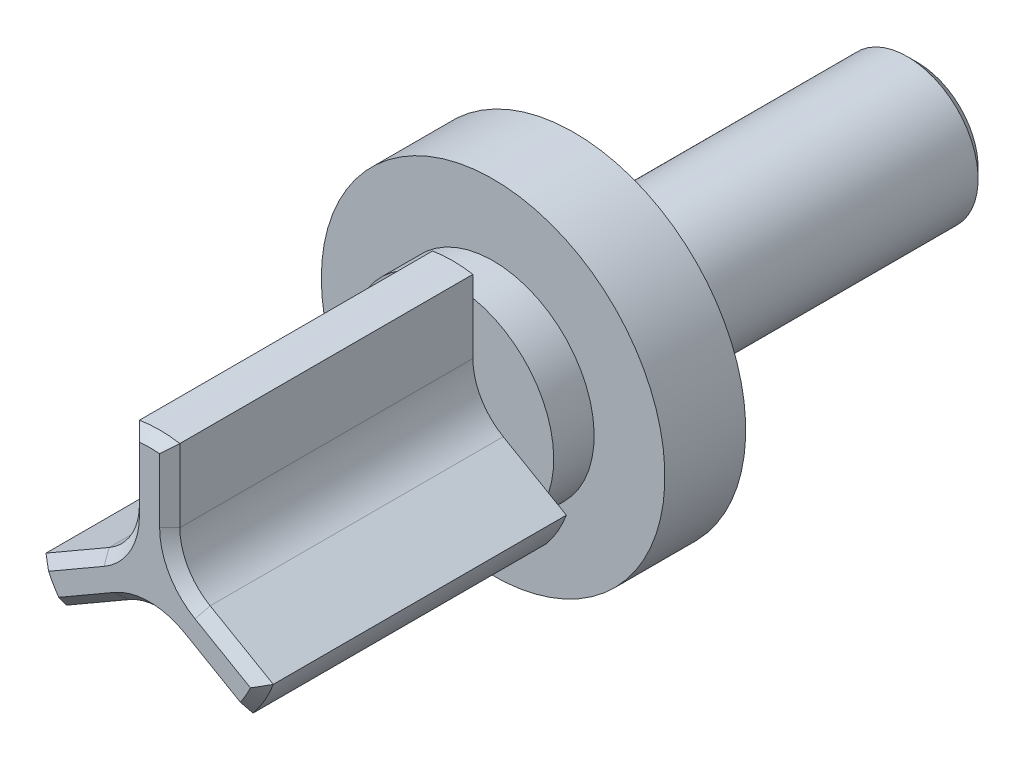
ISO-10303-21;
HEADER;
FILE_DESCRIPTION(('STEP AP214'),'2;1');
FILE_NAME('part.step','',(''),(''),'','','');
FILE_SCHEMA(('AUTOMOTIVE_DESIGN { 1 0 10303 214 1 1 1 1 }'));
ENDSEC;
DATA;
#1=APPLICATION_CONTEXT('core data for automotive mechanical design processes');
#2=APPLICATION_PROTOCOL_DEFINITION('international standard','automotive_design',2000,#1);
#3=PRODUCT_CONTEXT('',#1,'mechanical');
#4=PRODUCT('Part','Part','',(#3));
#5=PRODUCT_RELATED_PRODUCT_CATEGORY('part','',(#4));
#6=PRODUCT_DEFINITION_FORMATION('','',#4);
#7=PRODUCT_DEFINITION_CONTEXT('part definition',#1,'design');
#8=PRODUCT_DEFINITION('design','',#6,#7);
#9=PRODUCT_DEFINITION_SHAPE('','',#8);
#10=(LENGTH_UNIT() NAMED_UNIT(*) SI_UNIT(.MILLI.,.METRE.));
#11=(NAMED_UNIT(*) PLANE_ANGLE_UNIT() SI_UNIT($,.RADIAN.));
#12=(NAMED_UNIT(*) SI_UNIT($,.STERADIAN.) SOLID_ANGLE_UNIT());
#13=UNCERTAINTY_MEASURE_WITH_UNIT(LENGTH_MEASURE(1.E-05),#10,'distance_accuracy_value','');
#14=(GEOMETRIC_REPRESENTATION_CONTEXT(3) GLOBAL_UNCERTAINTY_ASSIGNED_CONTEXT((#13)) GLOBAL_UNIT_ASSIGNED_CONTEXT((#10,
#11,#12)) REPRESENTATION_CONTEXT('',''));
#15=CARTESIAN_POINT('',(0.,0.,0.));
#16=DIRECTION('',(0.,0.,1.));
#17=DIRECTION('',(1.,0.,0.));
#18=AXIS2_PLACEMENT_3D('',#15,#16,#17);
#19=CARTESIAN_POINT('',(0.,0.,-6.));
#20=DIRECTION('',(0.,0.,-1.));
#21=DIRECTION('',(-1.,0.,0.));
#22=AXIS2_PLACEMENT_3D('',#19,#20,#21);
#23=PLANE('',#22);
#24=CARTESIAN_POINT('',(0.,0.,-6.));
#25=DIRECTION('',(0.,0.,-1.));
#26=DIRECTION('',(-1.,0.,0.));
#27=AXIS2_PLACEMENT_3D('',#24,#25,#26);
#28=CIRCLE('',#27,8.5);
#29=CARTESIAN_POINT('',(-8.5,0.,-6.));
#30=VERTEX_POINT('',#29);
#31=EDGE_CURVE('E204',#30,#30,#28,.T.);
#32=ORIENTED_EDGE('',*,*,#31,.T.);
#33=EDGE_LOOP('',(#32));
#34=FACE_BOUND('',#33,.T.);
#35=CARTESIAN_POINT('',(0.,0.,-6.));
#36=DIRECTION('',(0.,0.,-1.));
#37=DIRECTION('',(-1.,0.,0.));
#38=AXIS2_PLACEMENT_3D('',#35,#36,#37);
#39=CIRCLE('',#38,3.5);
#40=CARTESIAN_POINT('',(-3.5,0.,-6.));
#41=VERTEX_POINT('',#40);
#42=EDGE_CURVE('E436',#41,#41,#39,.T.);
#43=ORIENTED_EDGE('',*,*,#42,.F.);
#44=EDGE_LOOP('',(#43));
#45=FACE_BOUND('',#44,.T.);
#46=ADVANCED_FACE('F31',(#34,#45),#23,.T.);
#47=CARTESIAN_POINT('',(4.,2.3094010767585,0.));
#48=DIRECTION('',(0.,0.,1.));
#49=DIRECTION('',(1.,0.,0.));
#50=AXIS2_PLACEMENT_3D('',#47,#48,#49);
#51=PLANE('',#50);
#52=CARTESIAN_POINT('',(0.,0.,0.));
#53=DIRECTION('',(0.,0.,-1.));
#54=DIRECTION('',(-1.,0.,0.));
#55=AXIS2_PLACEMENT_3D('',#52,#53,#54);
#56=CIRCLE('',#55,5.);
#57=CARTESIAN_POINT('',(-0.999999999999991,4.89897948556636,0.));
#58=VERTEX_POINT('',#57);
#59=CARTESIAN_POINT('',(1.,4.89897948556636,0.));
#60=VERTEX_POINT('',#59);
#61=EDGE_CURVE('E206',#58,#60,#56,.T.);
#62=ORIENTED_EDGE('',*,*,#61,.F.);
#63=DIRECTION('',(0.,-1.,0.));
#64=VECTOR('',#63,1.);
#65=CARTESIAN_POINT('',(-0.999999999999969,2.3094010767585,0.));
#66=LINE('',#65,#64);
#67=CARTESIAN_POINT('',(-1.,5.91607978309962,0.));
#68=VERTEX_POINT('',#67);
#69=EDGE_CURVE('E516',#68,#58,#66,.T.);
#70=ORIENTED_EDGE('',*,*,#69,.F.);
#71=CARTESIAN_POINT('',(0.,0.,0.));
#72=DIRECTION('',(0.,0.,1.));
#73=DIRECTION('',(1.,0.,0.));
#74=AXIS2_PLACEMENT_3D('',#71,#72,#73);
#75=CIRCLE('',#74,6.);
#76=CARTESIAN_POINT('',(1.,5.91607978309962,0.));
#77=VERTEX_POINT('',#76);
#78=EDGE_CURVE('E326',#77,#68,#75,.T.);
#79=ORIENTED_EDGE('',*,*,#78,.F.);
#80=DIRECTION('',(0.,1.,0.));
#81=VECTOR('',#80,1.);
#82=CARTESIAN_POINT('',(1.00000000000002,2.30940107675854,0.));
#83=LINE('',#82,#81);
#84=EDGE_CURVE('E514',#60,#77,#83,.T.);
#85=ORIENTED_EDGE('',*,*,#84,.F.);
#86=EDGE_LOOP('',(#62,#70,#79,#85));
#87=FACE_BOUND('',#86,.T.);
#88=ADVANCED_FACE('F462',(#87),#51,.F.);
#89=CARTESIAN_POINT('',(4.74264068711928,-1.58346433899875,0.));
#90=VERTEX_POINT('',#89);
#91=CARTESIAN_POINT('',(3.74264068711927,-3.31551514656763,0.));
#92=VERTEX_POINT('',#91);
#93=EDGE_CURVE('E211',#90,#92,#56,.T.);
#94=ORIENTED_EDGE('',*,*,#93,.F.);
#95=DIRECTION('',(-0.866025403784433,0.500000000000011,0.));
#96=VECTOR('',#95,1.);
#97=CARTESIAN_POINT('',(2.50000000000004,-0.288675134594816,0.));
#98=LINE('',#97,#96);
#99=CARTESIAN_POINT('',(5.62347538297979,-2.0920144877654,0.));
#100=VERTEX_POINT('',#99);
#101=EDGE_CURVE('E237',#100,#90,#98,.T.);
#102=ORIENTED_EDGE('',*,*,#101,.F.);
#103=CARTESIAN_POINT('',(0.,0.,0.));
#104=DIRECTION('',(0.,0.,1.));
#105=DIRECTION('',(1.,0.,0.));
#106=AXIS2_PLACEMENT_3D('',#103,#104,#105);
#107=CIRCLE('',#106,6.);
#108=CARTESIAN_POINT('',(4.62347538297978,-3.82406529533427,0.));
#109=VERTEX_POINT('',#108);
#110=EDGE_CURVE('E238',#109,#100,#107,.T.);
#111=ORIENTED_EDGE('',*,*,#110,.F.);
#112=DIRECTION('',(0.866025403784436,-0.500000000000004,0.));
#113=VECTOR('',#112,1.);
#114=CARTESIAN_POINT('',(1.49999999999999,-2.0207259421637,0.));
#115=LINE('',#114,#113);
#116=EDGE_CURVE('E381',#92,#109,#115,.T.);
#117=ORIENTED_EDGE('',*,*,#116,.F.);
#118=EDGE_LOOP('',(#94,#102,#111,#117));
#119=FACE_BOUND('',#118,.T.);
#120=ADVANCED_FACE('F475',(#119),#51,.F.);
#121=CARTESIAN_POINT('',(-3.74264068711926,-3.31551514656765,0.));
#122=VERTEX_POINT('',#121);
#123=CARTESIAN_POINT('',(-4.74264068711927,-1.58346433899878,0.));
#124=VERTEX_POINT('',#123);
#125=EDGE_CURVE('E191',#122,#124,#56,.T.);
#126=ORIENTED_EDGE('',*,*,#125,.F.);
#127=DIRECTION('',(0.866025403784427,0.500000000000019,0.));
#128=VECTOR('',#127,1.);
#129=CARTESIAN_POINT('',(-1.5,-2.02072594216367,0.));
#130=LINE('',#129,#128);
#131=CARTESIAN_POINT('',(-4.62347538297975,-3.82406529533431,0.));
#132=VERTEX_POINT('',#131);
#133=EDGE_CURVE('E524',#132,#122,#130,.T.);
#134=ORIENTED_EDGE('',*,*,#133,.F.);
#135=CARTESIAN_POINT('',(0.,0.,0.));
#136=DIRECTION('',(0.,0.,1.));
#137=DIRECTION('',(1.,0.,0.));
#138=AXIS2_PLACEMENT_3D('',#135,#136,#137);
#139=CIRCLE('',#138,6.);
#140=CARTESIAN_POINT('',(-5.62347538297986,-2.09201448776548,0.));
#141=VERTEX_POINT('',#140);
#142=EDGE_CURVE('E185',#141,#132,#139,.T.);
#143=ORIENTED_EDGE('',*,*,#142,.F.);
#144=DIRECTION('',(-0.866025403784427,-0.50000000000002,0.));
#145=VECTOR('',#144,1.);
#146=CARTESIAN_POINT('',(-2.5,-0.288675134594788,0.));
#147=LINE('',#146,#145);
#148=EDGE_CURVE('E177',#124,#141,#147,.T.);
#149=ORIENTED_EDGE('',*,*,#148,.F.);
#150=EDGE_LOOP('',(#126,#134,#143,#149));
#151=FACE_BOUND('',#150,.T.);
#152=ADVANCED_FACE('F188',(#151),#51,.F.);
#153=CARTESIAN_POINT('',(4.,2.3094010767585,15.));
#154=DIRECTION('',(0.,0.,-1.));
#155=DIRECTION('',(-1.,0.,0.));
#156=AXIS2_PLACEMENT_3D('',#153,#154,#155);
#157=CYLINDRICAL_SURFACE('',#156,2.99999999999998);
#158=DIRECTION('',(0.,0.,-1.));
#159=VECTOR('',#158,1.);
#160=CARTESIAN_POINT('',(1.00000000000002,2.30940107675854,15.));
#161=LINE('',#160,#159);
#162=CARTESIAN_POINT('',(1.00000000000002,2.30940107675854,14.5));
#163=VERTEX_POINT('',#162);
#164=CARTESIAN_POINT('',(1.00000000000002,2.30940107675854,0.));
#165=VERTEX_POINT('',#164);
#166=EDGE_CURVE('E212',#163,#165,#161,.T.);
#167=ORIENTED_EDGE('',*,*,#166,.F.);
#168=CARTESIAN_POINT('',(4.,2.3094010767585,14.5));
#169=DIRECTION('',(0.,0.,1.));
#170=DIRECTION('',(1.,0.,0.));
#171=AXIS2_PLACEMENT_3D('',#168,#169,#170);
#172=CIRCLE('',#171,2.99999999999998);
#173=CARTESIAN_POINT('',(2.50000000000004,-0.288675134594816,14.5));
#174=VERTEX_POINT('',#173);
#175=EDGE_CURVE('E11',#163,#174,#172,.T.);
#176=ORIENTED_EDGE('',*,*,#175,.T.);
#177=DIRECTION('',(0.,0.,-1.));
#178=VECTOR('',#177,1.);
#179=CARTESIAN_POINT('',(2.50000000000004,-0.288675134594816,15.));
#180=LINE('',#179,#178);
#181=CARTESIAN_POINT('',(2.50000000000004,-0.288675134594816,0.));
#182=VERTEX_POINT('',#181);
#183=EDGE_CURVE('E240',#174,#182,#180,.T.);
#184=ORIENTED_EDGE('',*,*,#183,.T.);
#185=CARTESIAN_POINT('',(4.,2.3094010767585,0.));
#186=DIRECTION('',(0.,0.,-1.));
#187=DIRECTION('',(1.,0.,0.));
#188=AXIS2_PLACEMENT_3D('',#185,#186,#187);
#189=CIRCLE('',#188,2.99999999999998);
#190=EDGE_CURVE('E222',#182,#165,#189,.T.);
#191=ORIENTED_EDGE('',*,*,#190,.T.);
#192=EDGE_LOOP('',(#167,#176,#184,#191));
#193=FACE_BOUND('',#192,.T.);
#194=ADVANCED_FACE('F33',(#193),#157,.F.);
#195=CARTESIAN_POINT('',(1.00000000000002,2.30940107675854,15.));
#196=DIRECTION('',(-1.,0.,0.));
#197=DIRECTION('',(0.,-1.,0.));
#198=AXIS2_PLACEMENT_3D('',#195,#196,#197);
#199=PLANE('',#198);
#200=DIRECTION('',(0.,0.,-1.));
#201=VECTOR('',#200,1.);
#202=CARTESIAN_POINT('',(1.,5.91607978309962,15.));
#203=LINE('',#202,#201);
#204=CARTESIAN_POINT('',(1.,5.91607978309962,14.5));
#205=VERTEX_POINT('',#204);
#206=EDGE_CURVE('E215',#205,#77,#203,.T.);
#207=ORIENTED_EDGE('',*,*,#206,.F.);
#208=DIRECTION('',(0.,-1.,0.));
#209=VECTOR('',#208,1.);
#210=CARTESIAN_POINT('',(1.00000000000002,2.30940107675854,14.5));
#211=LINE('',#210,#209);
#212=EDGE_CURVE('E39',#205,#163,#211,.T.);
#213=ORIENTED_EDGE('',*,*,#212,.T.);
#214=ORIENTED_EDGE('',*,*,#166,.T.);
#215=EDGE_CURVE('E230',#165,#60,#83,.T.);
#216=ORIENTED_EDGE('',*,*,#215,.T.);
#217=ORIENTED_EDGE('',*,*,#84,.T.);
#218=EDGE_LOOP('',(#207,#213,#214,#216,#217));
#219=FACE_BOUND('',#218,.T.);
#220=ADVANCED_FACE('F508',(#219),#199,.F.);
#221=CARTESIAN_POINT('',(0.,0.,15.));
#222=DIRECTION('',(0.,0.,-1.));
#223=DIRECTION('',(-1.,0.,0.));
#224=AXIS2_PLACEMENT_3D('',#221,#222,#223);
#225=CYLINDRICAL_SURFACE('',#224,6.);
#226=DIRECTION('',(0.,0.,-1.));
#227=VECTOR('',#226,1.);
#228=CARTESIAN_POINT('',(-1.,5.91607978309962,15.));
#229=LINE('',#228,#227);
#230=CARTESIAN_POINT('',(-1.,5.91607978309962,14.5));
#231=VERTEX_POINT('',#230);
#232=EDGE_CURVE('E262',#231,#68,#229,.T.);
#233=ORIENTED_EDGE('',*,*,#232,.F.);
#234=CARTESIAN_POINT('',(0.,0.,14.5));
#235=DIRECTION('',(0.,0.,1.));
#236=DIRECTION('',(1.,0.,0.));
#237=AXIS2_PLACEMENT_3D('',#234,#235,#236);
#238=CIRCLE('',#237,6.);
#239=EDGE_CURVE('E53',#231,#205,#238,.F.);
#240=ORIENTED_EDGE('',*,*,#239,.T.);
#241=ORIENTED_EDGE('',*,*,#206,.T.);
#242=ORIENTED_EDGE('',*,*,#78,.T.);
#243=EDGE_LOOP('',(#233,#240,#241,#242));
#244=FACE_BOUND('',#243,.T.);
#245=ADVANCED_FACE('F324',(#244),#225,.T.);
#246=CARTESIAN_POINT('',(-0.999999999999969,2.3094010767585,15.));
#247=DIRECTION('',(1.,0.,0.));
#248=DIRECTION('',(0.,1.,0.));
#249=AXIS2_PLACEMENT_3D('',#246,#247,#248);
#250=PLANE('',#249);
#251=DIRECTION('',(0.,0.,-1.));
#252=VECTOR('',#251,1.);
#253=CARTESIAN_POINT('',(-0.999999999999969,2.3094010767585,15.));
#254=LINE('',#253,#252);
#255=CARTESIAN_POINT('',(-0.999999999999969,2.3094010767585,14.5));
#256=VERTEX_POINT('',#255);
#257=CARTESIAN_POINT('',(-0.999999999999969,2.3094010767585,0.));
#258=VERTEX_POINT('',#257);
#259=EDGE_CURVE('E260',#256,#258,#254,.T.);
#260=ORIENTED_EDGE('',*,*,#259,.F.);
#261=DIRECTION('',(0.,1.,0.));
#262=VECTOR('',#261,1.);
#263=CARTESIAN_POINT('',(-1.,5.91607978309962,14.5));
#264=LINE('',#263,#262);
#265=EDGE_CURVE('E312',#256,#231,#264,.T.);
#266=ORIENTED_EDGE('',*,*,#265,.T.);
#267=ORIENTED_EDGE('',*,*,#232,.T.);
#268=ORIENTED_EDGE('',*,*,#69,.T.);
#269=EDGE_CURVE('E200',#58,#258,#66,.T.);
#270=ORIENTED_EDGE('',*,*,#269,.T.);
#271=EDGE_LOOP('',(#260,#266,#267,#268,#270));
#272=FACE_BOUND('',#271,.T.);
#273=ADVANCED_FACE('F317',(#272),#250,.F.);
#274=CARTESIAN_POINT('',(-3.99999999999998,2.30940107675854,15.));
#275=DIRECTION('',(0.,0.,-1.));
#276=DIRECTION('',(-1.,0.,0.));
#277=AXIS2_PLACEMENT_3D('',#274,#275,#276);
#278=CYLINDRICAL_SURFACE('',#277,3.);
#279=DIRECTION('',(0.,0.,-1.));
#280=VECTOR('',#279,1.);
#281=CARTESIAN_POINT('',(-2.5,-0.288675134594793,15.));
#282=LINE('',#281,#280);
#283=CARTESIAN_POINT('',(-2.5,-0.288675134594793,14.5));
#284=VERTEX_POINT('',#283);
#285=CARTESIAN_POINT('',(-2.5,-0.288675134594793,0.));
#286=VERTEX_POINT('',#285);
#287=EDGE_CURVE('E180',#284,#286,#282,.T.);
#288=ORIENTED_EDGE('',*,*,#287,.F.);
#289=CARTESIAN_POINT('',(-3.99999999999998,2.30940107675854,14.5));
#290=DIRECTION('',(0.,0.,1.));
#291=DIRECTION('',(1.,0.,0.));
#292=AXIS2_PLACEMENT_3D('',#289,#290,#291);
#293=CIRCLE('',#292,3.);
#294=EDGE_CURVE('E310',#284,#256,#293,.T.);
#295=ORIENTED_EDGE('',*,*,#294,.T.);
#296=ORIENTED_EDGE('',*,*,#259,.T.);
#297=CARTESIAN_POINT('',(-3.99999999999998,2.30940107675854,0.));
#298=DIRECTION('',(0.,0.,-1.));
#299=DIRECTION('',(1.,0.,0.));
#300=AXIS2_PLACEMENT_3D('',#297,#298,#299);
#301=CIRCLE('',#300,3.);
#302=EDGE_CURVE('E194',#258,#286,#301,.T.);
#303=ORIENTED_EDGE('',*,*,#302,.T.);
#304=EDGE_LOOP('',(#288,#295,#296,#303));
#305=FACE_BOUND('',#304,.T.);
#306=ADVANCED_FACE('F501',(#305),#278,.F.);
#307=CARTESIAN_POINT('',(-2.5,-0.288675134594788,15.));
#308=DIRECTION('',(0.50000000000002,-0.866025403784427,0.));
#309=DIRECTION('',(0.866025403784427,0.50000000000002,0.));
#310=AXIS2_PLACEMENT_3D('',#307,#308,#309);
#311=PLANE('',#310);
#312=DIRECTION('',(0.,0.,-1.));
#313=VECTOR('',#312,1.);
#314=CARTESIAN_POINT('',(-5.62347538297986,-2.09201448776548,15.));
#315=LINE('',#314,#313);
#316=CARTESIAN_POINT('',(-5.62347538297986,-2.09201448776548,14.5));
#317=VERTEX_POINT('',#316);
#318=EDGE_CURVE('E257',#317,#141,#315,.T.);
#319=ORIENTED_EDGE('',*,*,#318,.F.);
#320=DIRECTION('',(0.866025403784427,0.50000000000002,0.));
#321=VECTOR('',#320,1.);
#322=CARTESIAN_POINT('',(-2.5,-0.288675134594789,14.5));
#323=LINE('',#322,#321);
#324=EDGE_CURVE('E308',#317,#284,#323,.T.);
#325=ORIENTED_EDGE('',*,*,#324,.T.);
#326=ORIENTED_EDGE('',*,*,#287,.T.);
#327=EDGE_CURVE('E173',#286,#124,#147,.T.);
#328=ORIENTED_EDGE('',*,*,#327,.T.);
#329=ORIENTED_EDGE('',*,*,#148,.T.);
#330=EDGE_LOOP('',(#319,#325,#326,#328,#329));
#331=FACE_BOUND('',#330,.T.);
#332=ADVANCED_FACE('F176',(#331),#311,.F.);
#333=CARTESIAN_POINT('',(0.,0.,15.));
#334=DIRECTION('',(0.,0.,-1.));
#335=DIRECTION('',(-1.,0.,0.));
#336=AXIS2_PLACEMENT_3D('',#333,#334,#335);
#337=CYLINDRICAL_SURFACE('',#336,6.);
#338=DIRECTION('',(0.,0.,-1.));
#339=VECTOR('',#338,1.);
#340=CARTESIAN_POINT('',(-4.62347538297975,-3.82406529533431,15.));
#341=LINE('',#340,#339);
#342=CARTESIAN_POINT('',(-4.62347538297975,-3.82406529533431,14.5));
#343=VERTEX_POINT('',#342);
#344=EDGE_CURVE('E255',#343,#132,#341,.T.);
#345=ORIENTED_EDGE('',*,*,#344,.F.);
#346=CARTESIAN_POINT('',(0.,0.,14.5));
#347=DIRECTION('',(0.,0.,1.));
#348=DIRECTION('',(1.,0.,0.));
#349=AXIS2_PLACEMENT_3D('',#346,#347,#348);
#350=CIRCLE('',#349,6.);
#351=EDGE_CURVE('E306',#343,#317,#350,.F.);
#352=ORIENTED_EDGE('',*,*,#351,.T.);
#353=ORIENTED_EDGE('',*,*,#318,.T.);
#354=ORIENTED_EDGE('',*,*,#142,.T.);
#355=EDGE_LOOP('',(#345,#352,#353,#354));
#356=FACE_BOUND('',#355,.T.);
#357=ADVANCED_FACE('F494',(#356),#337,.T.);
#358=CARTESIAN_POINT('',(-1.5,-2.02072594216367,15.));
#359=DIRECTION('',(-0.500000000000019,0.866025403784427,0.));
#360=DIRECTION('',(-0.866025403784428,-0.500000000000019,0.));
#361=AXIS2_PLACEMENT_3D('',#358,#359,#360);
#362=PLANE('',#361);
#363=DIRECTION('',(0.,0.,-1.));
#364=VECTOR('',#363,1.);
#365=CARTESIAN_POINT('',(-1.5,-2.02072594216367,15.));
#366=LINE('',#365,#364);
#367=CARTESIAN_POINT('',(-1.5,-2.02072594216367,14.5));
#368=VERTEX_POINT('',#367);
#369=CARTESIAN_POINT('',(-1.5,-2.02072594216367,0.));
#370=VERTEX_POINT('',#369);
#371=EDGE_CURVE('E253',#368,#370,#366,.T.);
#372=ORIENTED_EDGE('',*,*,#371,.F.);
#373=DIRECTION('',(-0.866025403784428,-0.500000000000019,0.));
#374=VECTOR('',#373,1.);
#375=CARTESIAN_POINT('',(-4.62347538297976,-3.82406529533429,14.5));
#376=LINE('',#375,#374);
#377=EDGE_CURVE('E304',#368,#343,#376,.T.);
#378=ORIENTED_EDGE('',*,*,#377,.T.);
#379=ORIENTED_EDGE('',*,*,#344,.T.);
#380=ORIENTED_EDGE('',*,*,#133,.T.);
#381=EDGE_CURVE('E523',#122,#370,#130,.T.);
#382=ORIENTED_EDGE('',*,*,#381,.T.);
#383=EDGE_LOOP('',(#372,#378,#379,#380,#382));
#384=FACE_BOUND('',#383,.T.);
#385=ADVANCED_FACE('F490',(#384),#362,.F.);
#386=CARTESIAN_POINT('',(0.,-4.61880215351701,15.));
#387=DIRECTION('',(0.,0.,-1.));
#388=DIRECTION('',(-1.,0.,0.));
#389=AXIS2_PLACEMENT_3D('',#386,#387,#388);
#390=CYLINDRICAL_SURFACE('',#389,3.);
#391=DIRECTION('',(0.,0.,-1.));
#392=VECTOR('',#391,1.);
#393=CARTESIAN_POINT('',(1.49999999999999,-2.02072594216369,15.));
#394=LINE('',#393,#392);
#395=CARTESIAN_POINT('',(1.49999999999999,-2.02072594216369,14.5));
#396=VERTEX_POINT('',#395);
#397=CARTESIAN_POINT('',(1.49999999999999,-2.02072594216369,0.));
#398=VERTEX_POINT('',#397);
#399=EDGE_CURVE('E251',#396,#398,#394,.T.);
#400=ORIENTED_EDGE('',*,*,#399,.F.);
#401=CARTESIAN_POINT('',(0.,-4.61880215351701,14.5));
#402=DIRECTION('',(0.,0.,1.));
#403=DIRECTION('',(1.,0.,0.));
#404=AXIS2_PLACEMENT_3D('',#401,#402,#403);
#405=CIRCLE('',#404,3.);
#406=EDGE_CURVE('E302',#396,#368,#405,.T.);
#407=ORIENTED_EDGE('',*,*,#406,.T.);
#408=ORIENTED_EDGE('',*,*,#371,.T.);
#409=CARTESIAN_POINT('',(0.,-4.61880215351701,0.));
#410=DIRECTION('',(0.,0.,-1.));
#411=DIRECTION('',(1.,0.,0.));
#412=AXIS2_PLACEMENT_3D('',#409,#410,#411);
#413=CIRCLE('',#412,3.);
#414=EDGE_CURVE('E526',#370,#398,#413,.T.);
#415=ORIENTED_EDGE('',*,*,#414,.T.);
#416=EDGE_LOOP('',(#400,#407,#408,#415));
#417=FACE_BOUND('',#416,.T.);
#418=ADVANCED_FACE('F487',(#417),#390,.F.);
#419=CARTESIAN_POINT('',(1.49999999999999,-2.0207259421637,15.));
#420=DIRECTION('',(0.500000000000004,0.866025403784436,0.));
#421=DIRECTION('',(-0.866025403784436,0.500000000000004,0.));
#422=AXIS2_PLACEMENT_3D('',#419,#420,#421);
#423=PLANE('',#422);
#424=DIRECTION('',(0.,0.,-1.));
#425=VECTOR('',#424,1.);
#426=CARTESIAN_POINT('',(4.62347538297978,-3.82406529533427,15.));
#427=LINE('',#426,#425);
#428=CARTESIAN_POINT('',(4.62347538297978,-3.82406529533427,14.5));
#429=VERTEX_POINT('',#428);
#430=EDGE_CURVE('E249',#429,#109,#427,.T.);
#431=ORIENTED_EDGE('',*,*,#430,.F.);
#432=DIRECTION('',(-0.866025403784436,0.500000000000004,0.));
#433=VECTOR('',#432,1.);
#434=CARTESIAN_POINT('',(1.49999999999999,-2.0207259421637,14.5));
#435=LINE('',#434,#433);
#436=EDGE_CURVE('E300',#429,#396,#435,.T.);
#437=ORIENTED_EDGE('',*,*,#436,.T.);
#438=ORIENTED_EDGE('',*,*,#399,.T.);
#439=EDGE_CURVE('E242',#398,#92,#115,.T.);
#440=ORIENTED_EDGE('',*,*,#439,.T.);
#441=ORIENTED_EDGE('',*,*,#116,.T.);
#442=EDGE_LOOP('',(#431,#437,#438,#440,#441));
#443=FACE_BOUND('',#442,.T.);
#444=ADVANCED_FACE('F378',(#443),#423,.F.);
#445=CARTESIAN_POINT('',(0.,0.,15.));
#446=DIRECTION('',(0.,0.,-1.));
#447=DIRECTION('',(-1.,0.,0.));
#448=AXIS2_PLACEMENT_3D('',#445,#446,#447);
#449=CYLINDRICAL_SURFACE('',#448,6.);
#450=DIRECTION('',(0.,0.,-1.));
#451=VECTOR('',#450,1.);
#452=CARTESIAN_POINT('',(5.62347538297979,-2.0920144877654,15.));
#453=LINE('',#452,#451);
#454=CARTESIAN_POINT('',(5.62347538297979,-2.0920144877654,14.5));
#455=VERTEX_POINT('',#454);
#456=EDGE_CURVE('E247',#455,#100,#453,.T.);
#457=ORIENTED_EDGE('',*,*,#456,.F.);
#458=CARTESIAN_POINT('',(0.,0.,14.5));
#459=DIRECTION('',(0.,0.,1.));
#460=DIRECTION('',(1.,0.,0.));
#461=AXIS2_PLACEMENT_3D('',#458,#459,#460);
#462=CIRCLE('',#461,6.);
#463=EDGE_CURVE('E298',#455,#429,#462,.F.);
#464=ORIENTED_EDGE('',*,*,#463,.T.);
#465=ORIENTED_EDGE('',*,*,#430,.T.);
#466=ORIENTED_EDGE('',*,*,#110,.T.);
#467=EDGE_LOOP('',(#457,#464,#465,#466));
#468=FACE_BOUND('',#467,.T.);
#469=ADVANCED_FACE('F374',(#468),#449,.T.);
#470=CARTESIAN_POINT('',(2.50000000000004,-0.288675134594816,15.));
#471=DIRECTION('',(-0.500000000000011,-0.866025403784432,0.));
#472=DIRECTION('',(0.866025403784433,-0.500000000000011,0.));
#473=AXIS2_PLACEMENT_3D('',#470,#471,#472);
#474=PLANE('',#473);
#475=ORIENTED_EDGE('',*,*,#183,.F.);
#476=DIRECTION('',(0.866025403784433,-0.500000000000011,0.));
#477=VECTOR('',#476,1.);
#478=CARTESIAN_POINT('',(5.62347538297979,-2.0920144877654,14.5));
#479=LINE('',#478,#477);
#480=EDGE_CURVE('E295',#174,#455,#479,.T.);
#481=ORIENTED_EDGE('',*,*,#480,.T.);
#482=ORIENTED_EDGE('',*,*,#456,.T.);
#483=ORIENTED_EDGE('',*,*,#101,.T.);
#484=EDGE_CURVE('E232',#90,#182,#98,.T.);
#485=ORIENTED_EDGE('',*,*,#484,.T.);
#486=EDGE_LOOP('',(#475,#481,#482,#483,#485));
#487=FACE_BOUND('',#486,.T.);
#488=ADVANCED_FACE('F359',(#487),#474,.F.);
#489=CARTESIAN_POINT('',(4.,2.3094010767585,15.));
#490=DIRECTION('',(0.,0.,1.));
#491=DIRECTION('',(1.,0.,0.));
#492=AXIS2_PLACEMENT_3D('',#489,#490,#491);
#493=PLANE('',#492);
#494=CARTESIAN_POINT('',(0.,0.,15.));
#495=DIRECTION('',(0.,0.,1.));
#496=DIRECTION('',(1.,0.,0.));
#497=AXIS2_PLACEMENT_3D('',#494,#495,#496);
#498=CIRCLE('',#497,5.5);
#499=CARTESIAN_POINT('',(4.49341649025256,-3.17162548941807,15.));
#500=VERTEX_POINT('',#499);
#501=CARTESIAN_POINT('',(4.99341649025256,-2.30560008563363,15.));
#502=VERTEX_POINT('',#501);
#503=EDGE_CURVE('E290',#500,#502,#498,.T.);
#504=ORIENTED_EDGE('',*,*,#503,.T.);
#505=DIRECTION('',(-0.866025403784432,0.500000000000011,0.));
#506=VECTOR('',#505,1.);
#507=CARTESIAN_POINT('',(2.25000000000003,-0.721687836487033,15.));
#508=LINE('',#507,#506);
#509=CARTESIAN_POINT('',(2.25000000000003,-0.721687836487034,15.));
#510=VERTEX_POINT('',#509);
#511=EDGE_CURVE('E292',#502,#510,#508,.T.);
#512=ORIENTED_EDGE('',*,*,#511,.T.);
#513=CARTESIAN_POINT('',(4.,2.3094010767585,15.));
#514=DIRECTION('',(0.,0.,1.));
#515=DIRECTION('',(1.,0.,0.));
#516=AXIS2_PLACEMENT_3D('',#513,#514,#515);
#517=CIRCLE('',#516,3.49999999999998);
#518=CARTESIAN_POINT('',(0.500000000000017,2.30940107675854,15.));
#519=VERTEX_POINT('',#518);
#520=EDGE_CURVE('E270',#510,#519,#517,.F.);
#521=ORIENTED_EDGE('',*,*,#520,.T.);
#522=DIRECTION('',(0.,1.,0.));
#523=VECTOR('',#522,1.);
#524=CARTESIAN_POINT('',(0.5,5.91607978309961,15.));
#525=LINE('',#524,#523);
#526=CARTESIAN_POINT('',(0.500000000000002,5.47722557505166,15.));
#527=VERTEX_POINT('',#526);
#528=EDGE_CURVE('E272',#519,#527,#525,.T.);
#529=ORIENTED_EDGE('',*,*,#528,.T.);
#530=CARTESIAN_POINT('',(0.,0.,15.));
#531=DIRECTION('',(0.,0.,1.));
#532=DIRECTION('',(1.,0.,0.));
#533=AXIS2_PLACEMENT_3D('',#530,#531,#532);
#534=CIRCLE('',#533,5.5);
#535=CARTESIAN_POINT('',(-0.499999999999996,5.47722557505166,15.));
#536=VERTEX_POINT('',#535);
#537=EDGE_CURVE('E274',#527,#536,#534,.T.);
#538=ORIENTED_EDGE('',*,*,#537,.T.);
#539=DIRECTION('',(0.,-1.,0.));
#540=VECTOR('',#539,1.);
#541=CARTESIAN_POINT('',(-0.499999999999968,2.3094010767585,15.));
#542=LINE('',#541,#540);
#543=CARTESIAN_POINT('',(-0.499999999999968,2.30940107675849,15.));
#544=VERTEX_POINT('',#543);
#545=EDGE_CURVE('E276',#536,#544,#542,.T.);
#546=ORIENTED_EDGE('',*,*,#545,.T.);
#547=CARTESIAN_POINT('',(-3.99999999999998,2.30940107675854,15.));
#548=DIRECTION('',(0.,0.,1.));
#549=DIRECTION('',(1.,0.,0.));
#550=AXIS2_PLACEMENT_3D('',#547,#548,#549);
#551=CIRCLE('',#550,3.5);
#552=CARTESIAN_POINT('',(-2.24999999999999,-0.721687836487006,15.));
#553=VERTEX_POINT('',#552);
#554=EDGE_CURVE('E278',#544,#553,#551,.F.);
#555=ORIENTED_EDGE('',*,*,#554,.T.);
#556=DIRECTION('',(-0.866025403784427,-0.50000000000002,0.));
#557=VECTOR('',#556,1.);
#558=CARTESIAN_POINT('',(-5.37347538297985,-2.52502718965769,15.));
#559=LINE('',#558,#557);
#560=CARTESIAN_POINT('',(-4.99341649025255,-2.30560008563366,15.));
#561=VERTEX_POINT('',#560);
#562=EDGE_CURVE('E280',#553,#561,#559,.T.);
#563=ORIENTED_EDGE('',*,*,#562,.T.);
#564=CARTESIAN_POINT('',(0.,0.,15.));
#565=DIRECTION('',(0.,0.,1.));
#566=DIRECTION('',(1.,0.,0.));
#567=AXIS2_PLACEMENT_3D('',#564,#565,#566);
#568=CIRCLE('',#567,5.5);
#569=CARTESIAN_POINT('',(-4.49341649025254,-3.17162548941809,15.));
#570=VERTEX_POINT('',#569);
#571=EDGE_CURVE('E282',#561,#570,#568,.T.);
#572=ORIENTED_EDGE('',*,*,#571,.T.);
#573=DIRECTION('',(0.866025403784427,0.500000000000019,0.));
#574=VECTOR('',#573,1.);
#575=CARTESIAN_POINT('',(-1.75000000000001,-1.58771324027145,15.));
#576=LINE('',#575,#574);
#577=CARTESIAN_POINT('',(-1.75,-1.58771324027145,15.));
#578=VERTEX_POINT('',#577);
#579=EDGE_CURVE('E284',#570,#578,#576,.T.);
#580=ORIENTED_EDGE('',*,*,#579,.T.);
#581=CARTESIAN_POINT('',(0.,-4.61880215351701,15.));
#582=DIRECTION('',(0.,0.,1.));
#583=DIRECTION('',(1.,0.,0.));
#584=AXIS2_PLACEMENT_3D('',#581,#582,#583);
#585=CIRCLE('',#584,3.5);
#586=CARTESIAN_POINT('',(1.74999999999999,-1.58771324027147,15.));
#587=VERTEX_POINT('',#586);
#588=EDGE_CURVE('E286',#578,#587,#585,.F.);
#589=ORIENTED_EDGE('',*,*,#588,.T.);
#590=DIRECTION('',(0.866025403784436,-0.500000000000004,0.));
#591=VECTOR('',#590,1.);
#592=CARTESIAN_POINT('',(4.87347538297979,-3.39105259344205,15.));
#593=LINE('',#592,#591);
#594=EDGE_CURVE('E288',#587,#500,#593,.T.);
#595=ORIENTED_EDGE('',*,*,#594,.T.);
#596=EDGE_LOOP('',(#504,#512,#521,#529,#538,#546,#555,#563,#572,#580,#589,#595));
#597=FACE_BOUND('',#596,.T.);
#598=ADVANCED_FACE('F477',(#597),#493,.T.);
#599=CARTESIAN_POINT('',(0.,0.,0.));
#600=DIRECTION('',(0.,0.,-1.));
#601=DIRECTION('',(-1.,0.,0.));
#602=AXIS2_PLACEMENT_3D('',#599,#600,#601);
#603=PLANE('',#602);
#604=ORIENTED_EDGE('',*,*,#439,.F.);
#605=ORIENTED_EDGE('',*,*,#414,.F.);
#606=ORIENTED_EDGE('',*,*,#381,.F.);
#607=EDGE_CURVE('E203',#92,#122,#56,.T.);
#608=ORIENTED_EDGE('',*,*,#607,.F.);
#609=EDGE_LOOP('',(#604,#605,#606,#608));
#610=FACE_BOUND('',#609,.T.);
#611=ADVANCED_FACE('F469',(#610),#603,.F.);
#612=ORIENTED_EDGE('',*,*,#327,.F.);
#613=ORIENTED_EDGE('',*,*,#302,.F.);
#614=ORIENTED_EDGE('',*,*,#269,.F.);
#615=EDGE_CURVE('E197',#124,#58,#56,.T.);
#616=ORIENTED_EDGE('',*,*,#615,.F.);
#617=EDGE_LOOP('',(#612,#613,#614,#616));
#618=FACE_BOUND('',#617,.T.);
#619=ADVANCED_FACE('F198',(#618),#603,.F.);
#620=CARTESIAN_POINT('',(0.,0.,-2.));
#621=DIRECTION('',(0.,0.,1.));
#622=DIRECTION('',(1.,0.,0.));
#623=AXIS2_PLACEMENT_3D('',#620,#621,#622);
#624=CYLINDRICAL_SURFACE('',#623,5.);
#625=CARTESIAN_POINT('',(0.,0.,-2.));
#626=DIRECTION('',(0.,0.,-1.));
#627=DIRECTION('',(-1.,0.,0.));
#628=AXIS2_PLACEMENT_3D('',#625,#626,#627);
#629=CIRCLE('',#628,5.);
#630=CARTESIAN_POINT('',(-5.,0.,-2.));
#631=VERTEX_POINT('',#630);
#632=EDGE_CURVE('E219',#631,#631,#629,.T.);
#633=ORIENTED_EDGE('',*,*,#632,.F.);
#634=EDGE_LOOP('',(#633));
#635=FACE_BOUND('',#634,.T.);
#636=ORIENTED_EDGE('',*,*,#61,.T.);
#637=EDGE_CURVE('E214',#60,#90,#56,.T.);
#638=ORIENTED_EDGE('',*,*,#637,.T.);
#639=ORIENTED_EDGE('',*,*,#93,.T.);
#640=ORIENTED_EDGE('',*,*,#607,.T.);
#641=ORIENTED_EDGE('',*,*,#125,.T.);
#642=ORIENTED_EDGE('',*,*,#615,.T.);
#643=EDGE_LOOP('',(#636,#638,#639,#640,#641,#642));
#644=FACE_BOUND('',#643,.T.);
#645=ADVANCED_FACE('F208',(#635,#644),#624,.T.);
#646=ORIENTED_EDGE('',*,*,#484,.F.);
#647=ORIENTED_EDGE('',*,*,#637,.F.);
#648=ORIENTED_EDGE('',*,*,#215,.F.);
#649=ORIENTED_EDGE('',*,*,#190,.F.);
#650=EDGE_LOOP('',(#646,#647,#648,#649));
#651=FACE_BOUND('',#650,.T.);
#652=ADVANCED_FACE('F227',(#651),#603,.F.);
#653=CARTESIAN_POINT('',(0.,0.,-2.));
#654=DIRECTION('',(0.,0.,-1.));
#655=DIRECTION('',(-1.,0.,0.));
#656=AXIS2_PLACEMENT_3D('',#653,#654,#655);
#657=PLANE('',#656);
#658=CARTESIAN_POINT('',(0.,0.,-2.));
#659=DIRECTION('',(0.,0.,-1.));
#660=DIRECTION('',(-1.,0.,0.));
#661=AXIS2_PLACEMENT_3D('',#658,#659,#660);
#662=CIRCLE('',#661,8.5);
#663=CARTESIAN_POINT('',(-8.5,0.,-2.));
#664=VERTEX_POINT('',#663);
#665=EDGE_CURVE('E816',#664,#664,#662,.T.);
#666=ORIENTED_EDGE('',*,*,#665,.F.);
#667=EDGE_LOOP('',(#666));
#668=FACE_BOUND('',#667,.T.);
#669=ORIENTED_EDGE('',*,*,#632,.T.);
#670=EDGE_LOOP('',(#669));
#671=FACE_BOUND('',#670,.T.);
#672=ADVANCED_FACE('F456',(#668,#671),#657,.F.);
#673=CARTESIAN_POINT('',(0.,0.,-6.));
#674=DIRECTION('',(0.,0.,1.));
#675=DIRECTION('',(1.,0.,0.));
#676=AXIS2_PLACEMENT_3D('',#673,#674,#675);
#677=CYLINDRICAL_SURFACE('',#676,8.5);
#678=ORIENTED_EDGE('',*,*,#31,.F.);
#679=EDGE_LOOP('',(#678));
#680=FACE_BOUND('',#679,.T.);
#681=ORIENTED_EDGE('',*,*,#665,.T.);
#682=EDGE_LOOP('',(#681));
#683=FACE_BOUND('',#682,.T.);
#684=ADVANCED_FACE('F454',(#680,#683),#677,.T.);
#685=CARTESIAN_POINT('',(0.,0.,-23.));
#686=DIRECTION('',(0.,0.,1.));
#687=DIRECTION('',(1.,0.,0.));
#688=AXIS2_PLACEMENT_3D('',#685,#686,#687);
#689=CYLINDRICAL_SURFACE('',#688,3.5);
#690=CARTESIAN_POINT('',(0.,0.,-22.5));
#691=DIRECTION('',(0.,0.,-1.));
#692=DIRECTION('',(-1.,0.,0.));
#693=AXIS2_PLACEMENT_3D('',#690,#691,#692);
#694=CIRCLE('',#693,3.5);
#695=CARTESIAN_POINT('',(-3.5,0.,-22.5));
#696=VERTEX_POINT('',#695);
#697=EDGE_CURVE('E267',#696,#696,#694,.F.);
#698=ORIENTED_EDGE('',*,*,#697,.T.);
#699=EDGE_LOOP('',(#698));
#700=FACE_BOUND('',#699,.T.);
#701=ORIENTED_EDGE('',*,*,#42,.T.);
#702=EDGE_LOOP('',(#701));
#703=FACE_BOUND('',#702,.T.);
#704=ADVANCED_FACE('F450',(#700,#703),#689,.T.);
#705=CARTESIAN_POINT('',(0.,0.,-23.));
#706=DIRECTION('',(0.,0.,-1.));
#707=DIRECTION('',(-1.,0.,0.));
#708=AXIS2_PLACEMENT_3D('',#705,#706,#707);
#709=PLANE('',#708);
#710=CARTESIAN_POINT('',(0.,0.,-23.));
#711=DIRECTION('',(0.,0.,-1.));
#712=DIRECTION('',(-1.,0.,0.));
#713=AXIS2_PLACEMENT_3D('',#710,#711,#712);
#714=CIRCLE('',#713,3.);
#715=CARTESIAN_POINT('',(-3.,0.,-23.));
#716=VERTEX_POINT('',#715);
#717=EDGE_CURVE('E213',#716,#716,#714,.T.);
#718=ORIENTED_EDGE('',*,*,#717,.T.);
#719=EDGE_LOOP('',(#718));
#720=FACE_BOUND('',#719,.T.);
#721=ADVANCED_FACE('F446',(#720),#709,.T.);
#722=CARTESIAN_POINT('',(0.,0.,-23.));
#723=DIRECTION('',(0.,0.,1.));
#724=DIRECTION('',(1.,0.,0.));
#725=AXIS2_PLACEMENT_3D('',#722,#723,#724);
#726=CONICAL_SURFACE('',#725,3.,0.785398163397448);
#727=ORIENTED_EDGE('',*,*,#697,.F.);
#728=EDGE_LOOP('',(#727));
#729=FACE_BOUND('',#728,.T.);
#730=ORIENTED_EDGE('',*,*,#717,.F.);
#731=EDGE_LOOP('',(#730));
#732=FACE_BOUND('',#731,.T.);
#733=ADVANCED_FACE('F442',(#729,#732),#726,.T.);
#734=CARTESIAN_POINT('',(3.7499999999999,2.74241377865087,15.));
#735=DIRECTION('',(-0.353553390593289,0.612372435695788,0.707106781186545));
#736=DIRECTION('',(0.,-0.755928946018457,0.654653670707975));
#737=AXIS2_PLACEMENT_3D('',#734,#735,#736);
#738=PLANE('',#737);
#739=DIRECTION('',(0.353553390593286,-0.612372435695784,0.707106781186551));
#740=VECTOR('',#739,1.);
#741=CARTESIAN_POINT('',(-2.5,-0.288675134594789,14.5));
#742=LINE('',#741,#740);
#743=EDGE_CURVE('E437',#284,#553,#742,.T.);
#744=ORIENTED_EDGE('',*,*,#743,.F.);
#745=ORIENTED_EDGE('',*,*,#324,.F.);
#746=CARTESIAN_POINT('',(-5.62347538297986,-2.09201448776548,14.5));
#747=CARTESIAN_POINT('',(-5.5716132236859,-2.11068276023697,14.5420982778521));
#748=CARTESIAN_POINT('',(-5.5195963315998,-2.12914663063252,14.5840969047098));
#749=CARTESIAN_POINT('',(-5.41524744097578,-2.16564521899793,14.6678800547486));
#750=CARTESIAN_POINT('',(-5.36291546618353,-2.18367996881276,14.7096645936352));
#751=CARTESIAN_POINT('',(-5.25792262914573,-2.21930289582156,14.7930113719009));
#752=CARTESIAN_POINT('',(-5.20526176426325,-2.23689106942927,14.8345736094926));
#753=CARTESIAN_POINT('',(-5.09959755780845,-2.27160100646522,14.9174653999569));
#754=CARTESIAN_POINT('',(-5.04659419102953,-2.28872273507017,14.958794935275));
#755=CARTESIAN_POINT('',(-4.99341649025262,-2.30560008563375,15.));
#756=B_SPLINE_CURVE_WITH_KNOTS('',3,(#746,#747,#748,#749,#750,#751,#752,#753,#754,#755),
.UNSPECIFIED.,.F.,.F.,(4,2,2,2,4),(0.,0.208072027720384,0.416128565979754,0.624186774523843,
0.832260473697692),.UNSPECIFIED.);
#757=EDGE_CURVE('E429',#561,#317,#756,.F.);
#758=ORIENTED_EDGE('',*,*,#757,.F.);
#759=ORIENTED_EDGE('',*,*,#562,.F.);
#760=EDGE_LOOP('',(#744,#745,#758,#759));
#761=FACE_BOUND('',#760,.T.);
#762=ADVANCED_FACE('F417',(#761),#738,.T.);
#763=CARTESIAN_POINT('',(0.,0.,15.));
#764=DIRECTION('',(0.,0.,-1.));
#765=DIRECTION('',(-1.,0.,0.));
#766=AXIS2_PLACEMENT_3D('',#763,#764,#765);
#767=CONICAL_SURFACE('',#766,5.5,0.785398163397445);
#768=ORIENTED_EDGE('',*,*,#757,.T.);
#769=ORIENTED_EDGE('',*,*,#351,.F.);
#770=CARTESIAN_POINT('',(-4.62347538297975,-3.82406529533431,14.5));
#771=CARTESIAN_POINT('',(-4.61371150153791,-3.76981721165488,14.5420982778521));
#772=CARTESIAN_POINT('',(-4.60369323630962,-3.71553732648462,14.5840969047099));
#773=CARTESIAN_POINT('',(-4.58312749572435,-3.6069192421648,14.6678800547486));
#774=CARTESIAN_POINT('',(-4.57258005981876,-3.55258104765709,14.7096645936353));
#775=CARTESIAN_POINT('',(-4.55093400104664,-3.44384312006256,14.7930113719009));
#776=CARTESIAN_POINT('',(-4.53983537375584,-3.38944338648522,14.8345736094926));
#777=CARTESIAN_POINT('',(-4.51706295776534,-3.28058053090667,14.9174653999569));
#778=CARTESIAN_POINT('',(-4.50538912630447,-3.22611740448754,14.958794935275));
#779=CARTESIAN_POINT('',(-4.49341649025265,-3.17162548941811,15.));
#780=B_SPLINE_CURVE_WITH_KNOTS('',3,(#770,#771,#772,#773,#774,#775,#776,#777,#778,#779),
.UNSPECIFIED.,.F.,.F.,(4,2,2,2,4),(0.,0.208072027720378,0.416128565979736,0.624186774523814,
0.832260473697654),.UNSPECIFIED.);
#781=EDGE_CURVE('E423',#570,#343,#780,.F.);
#782=ORIENTED_EDGE('',*,*,#781,.F.);
#783=ORIENTED_EDGE('',*,*,#571,.F.);
#784=EDGE_LOOP('',(#768,#769,#782,#783));
#785=FACE_BOUND('',#784,.T.);
#786=ADVANCED_FACE('F412',(#785),#767,.T.);
#787=CARTESIAN_POINT('',(-3.99999999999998,2.30940107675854,15.));
#788=DIRECTION('',(0.,0.,1.));
#789=DIRECTION('',(1.,0.,0.));
#790=AXIS2_PLACEMENT_3D('',#787,#788,#789);
#791=CONICAL_SURFACE('',#790,3.5,0.785398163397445);
#792=ORIENTED_EDGE('',*,*,#743,.T.);
#793=ORIENTED_EDGE('',*,*,#554,.F.);
#794=DIRECTION('',(0.707106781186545,0.,0.70710678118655));
#795=VECTOR('',#794,1.);
#796=CARTESIAN_POINT('',(-0.999999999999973,2.3094010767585,14.5));
#797=LINE('',#796,#795);
#798=EDGE_CURVE('E550',#256,#544,#797,.T.);
#799=ORIENTED_EDGE('',*,*,#798,.F.);
#800=ORIENTED_EDGE('',*,*,#294,.F.);
#801=EDGE_LOOP('',(#792,#793,#799,#800));
#802=FACE_BOUND('',#801,.T.);
#803=ADVANCED_FACE('F416',(#802),#791,.F.);
#804=CARTESIAN_POINT('',(4.24999999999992,1.87638837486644,15.));
#805=DIRECTION('',(0.353553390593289,-0.612372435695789,0.707106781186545));
#806=DIRECTION('',(0.,-0.755928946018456,-0.654653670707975));
#807=AXIS2_PLACEMENT_3D('',#804,#805,#806);
#808=PLANE('',#807);
#809=ORIENTED_EDGE('',*,*,#781,.T.);
#810=ORIENTED_EDGE('',*,*,#377,.F.);
#811=DIRECTION('',(0.353553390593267,-0.612372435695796,-0.70710678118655));
#812=VECTOR('',#811,1.);
#813=CARTESIAN_POINT('',(-1.75,-1.58771324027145,15.));
#814=LINE('',#813,#812);
#815=EDGE_CURVE('E334',#578,#368,#814,.T.);
#816=ORIENTED_EDGE('',*,*,#815,.F.);
#817=ORIENTED_EDGE('',*,*,#579,.F.);
#818=EDGE_LOOP('',(#809,#810,#816,#817));
#819=FACE_BOUND('',#818,.T.);
#820=ADVANCED_FACE('F409',(#819),#808,.T.);
#821=CARTESIAN_POINT('',(-0.499999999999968,2.30940107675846,15.));
#822=DIRECTION('',(-0.70710678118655,0.,0.707106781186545));
#823=DIRECTION('',(0.707106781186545,0.,0.70710678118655));
#824=AXIS2_PLACEMENT_3D('',#821,#822,#823);
#825=PLANE('',#824);
#826=ORIENTED_EDGE('',*,*,#798,.T.);
#827=ORIENTED_EDGE('',*,*,#545,.F.);
#828=CARTESIAN_POINT('',(-1.,5.91607978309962,14.5));
#829=CARTESIAN_POINT('',(-0.957901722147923,5.88049997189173,14.5420982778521));
#830=CARTESIAN_POINT('',(-0.915903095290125,5.84468395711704,14.5840969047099));
#831=CARTESIAN_POINT('',(-0.832119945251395,5.77256446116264,14.6678800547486));
#832=CARTESIAN_POINT('',(-0.790335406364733,5.73626101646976,14.7096645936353));
#833=CARTESIAN_POINT('',(-0.706988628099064,5.66314601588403,14.7930113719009));
#834=CARTESIAN_POINT('',(-0.665426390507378,5.62633445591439,14.8345736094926));
#835=CARTESIAN_POINT('',(-0.582534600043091,5.5521815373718,14.9174653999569));
#836=CARTESIAN_POINT('',(-0.541205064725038,5.51484013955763,14.958794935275));
#837=CARTESIAN_POINT('',(-0.499999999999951,5.47722557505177,15.));
#838=B_SPLINE_CURVE_WITH_KNOTS('',3,(#828,#829,#830,#831,#832,#833,#834,#835,#836,#837),
.UNSPECIFIED.,.F.,.F.,(4,2,2,2,4),(0.,0.208072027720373,0.416128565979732,0.624186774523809,
0.832260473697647),.UNSPECIFIED.);
#839=EDGE_CURVE('E330',#231,#536,#838,.T.);
#840=ORIENTED_EDGE('',*,*,#839,.F.);
#841=ORIENTED_EDGE('',*,*,#265,.F.);
#842=EDGE_LOOP('',(#826,#827,#840,#841));
#843=FACE_BOUND('',#842,.T.);
#844=ADVANCED_FACE('F331',(#843),#825,.T.);
#845=CARTESIAN_POINT('',(0.,-4.61880215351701,15.));
#846=DIRECTION('',(0.,0.,1.));
#847=DIRECTION('',(1.,0.,0.));
#848=AXIS2_PLACEMENT_3D('',#845,#846,#847);
#849=CONICAL_SURFACE('',#848,3.5,0.785398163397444);
#850=ORIENTED_EDGE('',*,*,#815,.T.);
#851=ORIENTED_EDGE('',*,*,#406,.F.);
#852=DIRECTION('',(-0.353553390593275,-0.612372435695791,-0.70710678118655));
#853=VECTOR('',#852,1.);
#854=CARTESIAN_POINT('',(1.74999999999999,-1.58771324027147,15.));
#855=LINE('',#854,#853);
#856=EDGE_CURVE('E335',#587,#396,#855,.T.);
#857=ORIENTED_EDGE('',*,*,#856,.F.);
#858=ORIENTED_EDGE('',*,*,#588,.F.);
#859=EDGE_LOOP('',(#850,#851,#857,#858));
#860=FACE_BOUND('',#859,.T.);
#861=ADVANCED_FACE('F408',(#860),#849,.F.);
#862=CARTESIAN_POINT('',(0.,0.,15.));
#863=DIRECTION('',(0.,0.,-1.));
#864=DIRECTION('',(-1.,0.,0.));
#865=AXIS2_PLACEMENT_3D('',#862,#863,#864);
#866=CONICAL_SURFACE('',#865,5.5,0.785398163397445);
#867=ORIENTED_EDGE('',*,*,#839,.T.);
#868=ORIENTED_EDGE('',*,*,#537,.F.);
#869=CARTESIAN_POINT('',(1.,5.91607978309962,14.5));
#870=CARTESIAN_POINT('',(0.957901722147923,5.88049997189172,14.5420982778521));
#871=CARTESIAN_POINT('',(0.915903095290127,5.84468395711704,14.5840969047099));
#872=CARTESIAN_POINT('',(0.832119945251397,5.77256446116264,14.6678800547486));
#873=CARTESIAN_POINT('',(0.790335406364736,5.73626101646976,14.7096645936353));
#874=CARTESIAN_POINT('',(0.706988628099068,5.66314601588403,14.7930113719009));
#875=CARTESIAN_POINT('',(0.665426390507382,5.62633445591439,14.8345736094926));
#876=CARTESIAN_POINT('',(0.582534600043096,5.5521815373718,14.9174653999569));
#877=CARTESIAN_POINT('',(0.541205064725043,5.51484013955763,14.958794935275));
#878=CARTESIAN_POINT('',(0.499999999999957,5.47722557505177,15.));
#879=B_SPLINE_CURVE_WITH_KNOTS('',3,(#869,#870,#871,#872,#873,#874,#875,#876,#877,#878),
.UNSPECIFIED.,.F.,.F.,(4,2,2,2,4),(0.,0.208072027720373,0.41612856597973,0.624186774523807,
0.832260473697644),.UNSPECIFIED.);
#880=EDGE_CURVE('E340',#205,#527,#879,.T.);
#881=ORIENTED_EDGE('',*,*,#880,.F.);
#882=ORIENTED_EDGE('',*,*,#239,.F.);
#883=EDGE_LOOP('',(#867,#868,#881,#882));
#884=FACE_BOUND('',#883,.T.);
#885=ADVANCED_FACE('F338',(#884),#866,.T.);
#886=CARTESIAN_POINT('',(1.74999999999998,-1.58771324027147,15.));
#887=DIRECTION('',(-0.353553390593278,-0.612372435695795,0.707106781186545));
#888=DIRECTION('',(0.,-0.755928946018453,-0.654653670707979));
#889=AXIS2_PLACEMENT_3D('',#886,#887,#888);
#890=PLANE('',#889);
#891=ORIENTED_EDGE('',*,*,#856,.T.);
#892=ORIENTED_EDGE('',*,*,#436,.F.);
#893=CARTESIAN_POINT('',(4.62347538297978,-3.82406529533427,14.5));
#894=CARTESIAN_POINT('',(4.61371150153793,-3.76981721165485,14.5420982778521));
#895=CARTESIAN_POINT('',(4.60369323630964,-3.71553732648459,14.5840969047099));
#896=CARTESIAN_POINT('',(4.58312749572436,-3.60691924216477,14.6678800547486));
#897=CARTESIAN_POINT('',(4.57258005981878,-3.55258104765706,14.7096645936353));
#898=CARTESIAN_POINT('',(4.55093400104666,-3.44384312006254,14.7930113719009));
#899=CARTESIAN_POINT('',(4.53983537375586,-3.38944338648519,14.8345736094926));
#900=CARTESIAN_POINT('',(4.51706295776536,-3.28058053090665,14.9174653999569));
#901=CARTESIAN_POINT('',(4.50538912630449,-3.22611740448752,14.958794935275));
#902=CARTESIAN_POINT('',(4.49341649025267,-3.17162548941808,15.));
#903=B_SPLINE_CURVE_WITH_KNOTS('',3,(#893,#894,#895,#896,#897,#898,#899,#900,#901,#902),
.UNSPECIFIED.,.F.,.F.,(4,2,2,2,4),(0.,0.208072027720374,0.416128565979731,0.624186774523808,
0.832260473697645),.UNSPECIFIED.);
#904=EDGE_CURVE('E343',#500,#429,#903,.F.);
#905=ORIENTED_EDGE('',*,*,#904,.F.);
#906=ORIENTED_EDGE('',*,*,#594,.F.);
#907=EDGE_LOOP('',(#891,#892,#905,#906));
#908=FACE_BOUND('',#907,.T.);
#909=ADVANCED_FACE('F385',(#908),#890,.T.);
#910=CARTESIAN_POINT('',(0.500000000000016,2.30940107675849,15.));
#911=DIRECTION('',(0.70710678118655,0.,0.707106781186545));
#912=DIRECTION('',(0.707106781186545,0.,-0.70710678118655));
#913=AXIS2_PLACEMENT_3D('',#910,#911,#912);
#914=PLANE('',#913);
#915=ORIENTED_EDGE('',*,*,#880,.T.);
#916=ORIENTED_EDGE('',*,*,#528,.F.);
#917=DIRECTION('',(-0.707106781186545,0.,0.70710678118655));
#918=VECTOR('',#917,1.);
#919=CARTESIAN_POINT('',(1.00000000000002,2.30940107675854,14.5));
#920=LINE('',#919,#918);
#921=EDGE_CURVE('E348',#163,#519,#920,.T.);
#922=ORIENTED_EDGE('',*,*,#921,.F.);
#923=ORIENTED_EDGE('',*,*,#212,.F.);
#924=EDGE_LOOP('',(#915,#916,#922,#923));
#925=FACE_BOUND('',#924,.T.);
#926=ADVANCED_FACE('F346',(#925),#914,.T.);
#927=CARTESIAN_POINT('',(0.,0.,15.));
#928=DIRECTION('',(0.,0.,-1.));
#929=DIRECTION('',(-1.,0.,0.));
#930=AXIS2_PLACEMENT_3D('',#927,#928,#929);
#931=CONICAL_SURFACE('',#930,5.5,0.785398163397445);
#932=ORIENTED_EDGE('',*,*,#904,.T.);
#933=ORIENTED_EDGE('',*,*,#463,.F.);
#934=CARTESIAN_POINT('',(5.62347538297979,-2.0920144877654,14.5));
#935=CARTESIAN_POINT('',(5.57161322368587,-2.11068276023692,14.5420982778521));
#936=CARTESIAN_POINT('',(5.51959633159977,-2.1291466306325,14.5840969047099));
#937=CARTESIAN_POINT('',(5.41524744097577,-2.16564521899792,14.6678800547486));
#938=CARTESIAN_POINT('',(5.36291546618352,-2.18367996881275,14.7096645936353));
#939=CARTESIAN_POINT('',(5.25792262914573,-2.21930289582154,14.7930113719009));
#940=CARTESIAN_POINT('',(5.20526176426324,-2.23689106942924,14.8345736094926));
#941=CARTESIAN_POINT('',(5.09959755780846,-2.2716010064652,14.9174653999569));
#942=CARTESIAN_POINT('',(5.04659419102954,-2.28872273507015,14.958794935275));
#943=CARTESIAN_POINT('',(4.99341649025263,-2.30560008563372,15.));
#944=B_SPLINE_CURVE_WITH_KNOTS('',3,(#934,#935,#936,#937,#938,#939,#940,#941,#942,#943),
.UNSPECIFIED.,.F.,.F.,(4,2,2,2,4),(0.,0.208072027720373,0.41612856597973,0.624186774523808,
0.832260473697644),.UNSPECIFIED.);
#945=EDGE_CURVE('E352',#502,#455,#944,.F.);
#946=ORIENTED_EDGE('',*,*,#945,.F.);
#947=ORIENTED_EDGE('',*,*,#503,.F.);
#948=EDGE_LOOP('',(#932,#933,#946,#947));
#949=FACE_BOUND('',#948,.T.);
#950=ADVANCED_FACE('F370',(#949),#931,.T.);
#951=CARTESIAN_POINT('',(4.,2.3094010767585,15.));
#952=DIRECTION('',(0.,0.,1.));
#953=DIRECTION('',(1.,0.,0.));
#954=AXIS2_PLACEMENT_3D('',#951,#952,#953);
#955=CONICAL_SURFACE('',#954,3.49999999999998,0.785398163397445);
#956=ORIENTED_EDGE('',*,*,#921,.T.);
#957=ORIENTED_EDGE('',*,*,#520,.F.);
#958=DIRECTION('',(-0.35355339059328,-0.612372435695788,0.70710678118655));
#959=VECTOR('',#958,1.);
#960=CARTESIAN_POINT('',(2.50000000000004,-0.288675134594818,14.5));
#961=LINE('',#960,#959);
#962=EDGE_CURVE('E356',#174,#510,#961,.T.);
#963=ORIENTED_EDGE('',*,*,#962,.F.);
#964=ORIENTED_EDGE('',*,*,#175,.F.);
#965=EDGE_LOOP('',(#956,#957,#963,#964));
#966=FACE_BOUND('',#965,.T.);
#967=ADVANCED_FACE('F355',(#966),#955,.F.);
#968=CARTESIAN_POINT('',(2.24999999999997,-0.721687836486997,15.));
#969=DIRECTION('',(0.353553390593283,0.612372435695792,0.707106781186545));
#970=DIRECTION('',(0.,-0.755928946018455,0.654653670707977));
#971=AXIS2_PLACEMENT_3D('',#968,#969,#970);
#972=PLANE('',#971);
#973=ORIENTED_EDGE('',*,*,#945,.T.);
#974=ORIENTED_EDGE('',*,*,#480,.F.);
#975=ORIENTED_EDGE('',*,*,#962,.T.);
#976=ORIENTED_EDGE('',*,*,#511,.F.);
#977=EDGE_LOOP('',(#973,#974,#975,#976));
#978=FACE_BOUND('',#977,.T.);
#979=ADVANCED_FACE('F362',(#978),#972,.T.);
#980=CLOSED_SHELL('',(#46,#88,#120,#152,#194,#220,#245,#273,#306,#332,#357,#385,#418,#444,#469,
#488,#598,#611,#619,#645,#652,#672,#684,#704,#721,#733,#762,#786,#803,#820,#844,#861,#885,#909,
#926,#950,#967,#979));
#981=MANIFOLD_SOLID_BREP('B2',#980);
#982=ADVANCED_BREP_SHAPE_REPRESENTATION('',(#18,#981),#14);
#983=SHAPE_DEFINITION_REPRESENTATION(#9,#982);
ENDSEC;
END-ISO-10303-21;
